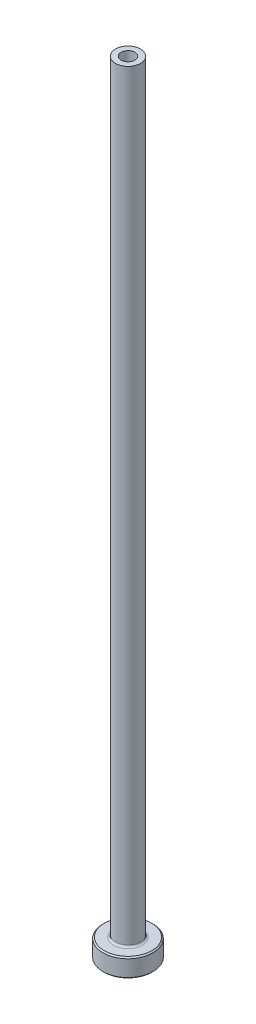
ISO-10303-21;
HEADER;
FILE_DESCRIPTION(('STEP AP214'),'2;1');
FILE_NAME('part.step','',(''),(''),'','','');
FILE_SCHEMA(('AUTOMOTIVE_DESIGN { 1 0 10303 214 1 1 1 1 }'));
ENDSEC;
DATA;
#1=APPLICATION_CONTEXT('core data for automotive mechanical design processes');
#2=APPLICATION_PROTOCOL_DEFINITION('international standard','automotive_design',2000,#1);
#3=PRODUCT_CONTEXT('',#1,'mechanical');
#4=PRODUCT('Part','Part','',(#3));
#5=PRODUCT_RELATED_PRODUCT_CATEGORY('part','',(#4));
#6=PRODUCT_DEFINITION_FORMATION('','',#4);
#7=PRODUCT_DEFINITION_CONTEXT('part definition',#1,'design');
#8=PRODUCT_DEFINITION('design','',#6,#7);
#9=PRODUCT_DEFINITION_SHAPE('','',#8);
#10=(LENGTH_UNIT() NAMED_UNIT(*) SI_UNIT(.MILLI.,.METRE.));
#11=(NAMED_UNIT(*) PLANE_ANGLE_UNIT() SI_UNIT($,.RADIAN.));
#12=(NAMED_UNIT(*) SI_UNIT($,.STERADIAN.) SOLID_ANGLE_UNIT());
#13=UNCERTAINTY_MEASURE_WITH_UNIT(LENGTH_MEASURE(1.E-05),#10,'distance_accuracy_value','');
#14=(GEOMETRIC_REPRESENTATION_CONTEXT(3) GLOBAL_UNCERTAINTY_ASSIGNED_CONTEXT((#13)) GLOBAL_UNIT_ASSIGNED_CONTEXT((#10,
#11,#12)) REPRESENTATION_CONTEXT('',''));
#15=CARTESIAN_POINT('',(0.,0.,0.));
#16=DIRECTION('',(0.,0.,1.));
#17=DIRECTION('',(1.,0.,0.));
#18=AXIS2_PLACEMENT_3D('',#15,#16,#17);
#19=CARTESIAN_POINT('',(0.,92.1876809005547,0.));
#20=DIRECTION('',(0.,1.,0.));
#21=DIRECTION('',(0.,0.,1.));
#22=AXIS2_PLACEMENT_3D('',#19,#20,#21);
#23=CYLINDRICAL_SURFACE('',#22,1.1);
#24=CARTESIAN_POINT('',(0.,125.,0.));
#25=DIRECTION('',(0.,1.,0.));
#26=DIRECTION('',(0.,0.,1.));
#27=AXIS2_PLACEMENT_3D('',#24,#25,#26);
#28=CIRCLE('',#27,1.1);
#29=CARTESIAN_POINT('',(0.,125.,1.1));
#30=VERTEX_POINT('',#29);
#31=EDGE_CURVE('E62',#30,#30,#28,.T.);
#32=ORIENTED_EDGE('',*,*,#31,.T.);
#33=EDGE_LOOP('',(#32));
#34=FACE_BOUND('',#33,.T.);
#35=CARTESIAN_POINT('',(0.,90.,0.));
#36=DIRECTION('',(0.,1.,0.));
#37=DIRECTION('',(0.,0.,1.));
#38=AXIS2_PLACEMENT_3D('',#35,#36,#37);
#39=CIRCLE('',#38,1.1);
#40=CARTESIAN_POINT('',(0.,90.,1.1));
#41=VERTEX_POINT('',#40);
#42=EDGE_CURVE('E71',#41,#41,#39,.T.);
#43=ORIENTED_EDGE('',*,*,#42,.F.);
#44=EDGE_LOOP('',(#43));
#45=FACE_BOUND('',#44,.T.);
#46=ADVANCED_FACE('F30',(#34,#45),#23,.F.);
#47=CARTESIAN_POINT('',(-1.1,125.,0.));
#48=DIRECTION('',(0.,1.,0.));
#49=DIRECTION('',(0.,0.,1.));
#50=AXIS2_PLACEMENT_3D('',#47,#48,#49);
#51=PLANE('',#50);
#52=CARTESIAN_POINT('',(0.,125.,0.));
#53=DIRECTION('',(0.,1.,0.));
#54=DIRECTION('',(0.,0.,1.));
#55=AXIS2_PLACEMENT_3D('',#52,#53,#54);
#56=CIRCLE('',#55,2.);
#57=CARTESIAN_POINT('',(0.,125.,2.));
#58=VERTEX_POINT('',#57);
#59=EDGE_CURVE('E65',#58,#58,#56,.T.);
#60=ORIENTED_EDGE('',*,*,#59,.T.);
#61=EDGE_LOOP('',(#60));
#62=FACE_BOUND('',#61,.T.);
#63=ORIENTED_EDGE('',*,*,#31,.F.);
#64=EDGE_LOOP('',(#63));
#65=FACE_BOUND('',#64,.T.);
#66=ADVANCED_FACE('F79',(#62,#65),#51,.T.);
#67=CARTESIAN_POINT('',(0.,92.1876809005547,0.));
#68=DIRECTION('',(0.,1.,0.));
#69=DIRECTION('',(0.,0.,1.));
#70=AXIS2_PLACEMENT_3D('',#67,#68,#69);
#71=CYLINDRICAL_SURFACE('',#70,2.);
#72=CARTESIAN_POINT('',(0.,3.3,0.));
#73=DIRECTION('',(0.,1.,0.));
#74=DIRECTION('',(0.,0.,1.));
#75=AXIS2_PLACEMENT_3D('',#72,#73,#74);
#76=CIRCLE('',#75,2.);
#77=CARTESIAN_POINT('',(0.,3.3,2.));
#78=VERTEX_POINT('',#77);
#79=EDGE_CURVE('E59',#78,#78,#76,.T.);
#80=ORIENTED_EDGE('',*,*,#79,.T.);
#81=EDGE_LOOP('',(#80));
#82=FACE_BOUND('',#81,.T.);
#83=ORIENTED_EDGE('',*,*,#59,.F.);
#84=EDGE_LOOP('',(#83));
#85=FACE_BOUND('',#84,.T.);
#86=ADVANCED_FACE('F85',(#82,#85),#71,.T.);
#87=CARTESIAN_POINT('',(-1.99999999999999,3.,0.));
#88=DIRECTION('',(0.,1.,0.));
#89=DIRECTION('',(0.,0.,1.));
#90=AXIS2_PLACEMENT_3D('',#87,#88,#89);
#91=PLANE('',#90);
#92=CARTESIAN_POINT('',(0.,3.,0.));
#93=DIRECTION('',(0.,1.,0.));
#94=DIRECTION('',(0.,0.,1.));
#95=AXIS2_PLACEMENT_3D('',#92,#93,#94);
#96=CIRCLE('',#95,3.79999999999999);
#97=CARTESIAN_POINT('',(0.,3.,3.79999999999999));
#98=VERTEX_POINT('',#97);
#99=EDGE_CURVE('E53',#98,#98,#96,.T.);
#100=ORIENTED_EDGE('',*,*,#99,.T.);
#101=EDGE_LOOP('',(#100));
#102=FACE_BOUND('',#101,.T.);
#103=CARTESIAN_POINT('',(0.,3.,0.));
#104=DIRECTION('',(0.,1.,0.));
#105=DIRECTION('',(0.,0.,1.));
#106=AXIS2_PLACEMENT_3D('',#103,#104,#105);
#107=CIRCLE('',#106,2.3);
#108=CARTESIAN_POINT('',(0.,3.,2.3));
#109=VERTEX_POINT('',#108);
#110=EDGE_CURVE('E56',#109,#109,#107,.F.);
#111=ORIENTED_EDGE('',*,*,#110,.T.);
#112=EDGE_LOOP('',(#111));
#113=FACE_BOUND('',#112,.T.);
#114=ADVANCED_FACE('F111',(#102,#113),#91,.T.);
#115=CARTESIAN_POINT('',(0.,92.1876809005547,0.));
#116=DIRECTION('',(0.,1.,0.));
#117=DIRECTION('',(0.,0.,1.));
#118=AXIS2_PLACEMENT_3D('',#115,#116,#117);
#119=CYLINDRICAL_SURFACE('',#118,3.99999999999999);
#120=CARTESIAN_POINT('',(0.,2.8,0.));
#121=DIRECTION('',(0.,1.,0.));
#122=DIRECTION('',(0.,0.,1.));
#123=AXIS2_PLACEMENT_3D('',#120,#121,#122);
#124=CIRCLE('',#123,3.99999999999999);
#125=CARTESIAN_POINT('',(0.,2.8,3.99999999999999));
#126=VERTEX_POINT('',#125);
#127=EDGE_CURVE('E45',#126,#126,#124,.F.);
#128=ORIENTED_EDGE('',*,*,#127,.T.);
#129=EDGE_LOOP('',(#128));
#130=FACE_BOUND('',#129,.T.);
#131=CARTESIAN_POINT('',(0.,0.200000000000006,0.));
#132=DIRECTION('',(0.,-1.,0.));
#133=DIRECTION('',(0.,0.,-1.));
#134=AXIS2_PLACEMENT_3D('',#131,#132,#133);
#135=CIRCLE('',#134,3.99999999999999);
#136=CARTESIAN_POINT('',(0.,0.200000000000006,-3.99999999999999));
#137=VERTEX_POINT('',#136);
#138=EDGE_CURVE('E50',#137,#137,#135,.F.);
#139=ORIENTED_EDGE('',*,*,#138,.T.);
#140=EDGE_LOOP('',(#139));
#141=FACE_BOUND('',#140,.T.);
#142=ADVANCED_FACE('F108',(#130,#141),#119,.T.);
#143=CARTESIAN_POINT('',(-3.99999999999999,0.,0.));
#144=DIRECTION('',(0.,-1.,0.));
#145=DIRECTION('',(0.,0.,-1.));
#146=AXIS2_PLACEMENT_3D('',#143,#144,#145);
#147=PLANE('',#146);
#148=CARTESIAN_POINT('',(0.,0.,0.));
#149=DIRECTION('',(0.,-1.,0.));
#150=DIRECTION('',(0.,0.,-1.));
#151=AXIS2_PLACEMENT_3D('',#148,#149,#150);
#152=CIRCLE('',#151,1.84999999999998);
#153=CARTESIAN_POINT('',(0.,0.,-1.84999999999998));
#154=VERTEX_POINT('',#153);
#155=EDGE_CURVE('E37',#154,#154,#152,.F.);
#156=ORIENTED_EDGE('',*,*,#155,.T.);
#157=EDGE_LOOP('',(#156));
#158=FACE_BOUND('',#157,.T.);
#159=CARTESIAN_POINT('',(0.,0.,0.));
#160=DIRECTION('',(0.,-1.,0.));
#161=DIRECTION('',(0.,0.,-1.));
#162=AXIS2_PLACEMENT_3D('',#159,#160,#161);
#163=CIRCLE('',#162,3.79999999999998);
#164=CARTESIAN_POINT('',(0.,0.,-3.79999999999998));
#165=VERTEX_POINT('',#164);
#166=EDGE_CURVE('E41',#165,#165,#163,.T.);
#167=ORIENTED_EDGE('',*,*,#166,.T.);
#168=EDGE_LOOP('',(#167));
#169=FACE_BOUND('',#168,.T.);
#170=ADVANCED_FACE('F110',(#158,#169),#147,.T.);
#171=CARTESIAN_POINT('',(0.,92.1876809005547,0.));
#172=DIRECTION('',(0.,1.,0.));
#173=DIRECTION('',(0.,0.,1.));
#174=AXIS2_PLACEMENT_3D('',#171,#172,#173);
#175=CYLINDRICAL_SURFACE('',#174,1.34999999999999);
#176=CARTESIAN_POINT('',(0.,0.499999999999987,0.));
#177=DIRECTION('',(0.,-1.,0.));
#178=DIRECTION('',(0.,0.,-1.));
#179=AXIS2_PLACEMENT_3D('',#176,#177,#178);
#180=CIRCLE('',#179,1.34999999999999);
#181=CARTESIAN_POINT('',(0.,0.499999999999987,-1.34999999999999));
#182=VERTEX_POINT('',#181);
#183=EDGE_CURVE('E10',#182,#182,#180,.T.);
#184=ORIENTED_EDGE('',*,*,#183,.T.);
#185=EDGE_LOOP('',(#184));
#186=FACE_BOUND('',#185,.T.);
#187=CARTESIAN_POINT('',(0.,78.,0.));
#188=DIRECTION('',(0.,1.,0.));
#189=DIRECTION('',(0.,0.,1.));
#190=AXIS2_PLACEMENT_3D('',#187,#188,#189);
#191=CIRCLE('',#190,1.35);
#192=CARTESIAN_POINT('',(0.,78.,1.35));
#193=VERTEX_POINT('',#192);
#194=EDGE_CURVE('E68',#193,#193,#191,.T.);
#195=ORIENTED_EDGE('',*,*,#194,.T.);
#196=EDGE_LOOP('',(#195));
#197=FACE_BOUND('',#196,.T.);
#198=ADVANCED_FACE('F118',(#186,#197),#175,.F.);
#199=CARTESIAN_POINT('',(0.,78.,0.));
#200=DIRECTION('',(0.,-1.,0.));
#201=DIRECTION('',(0.,0.,-1.));
#202=AXIS2_PLACEMENT_3D('',#199,#200,#201);
#203=CONICAL_SURFACE('',#202,1.35,0.0208303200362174);
#204=ORIENTED_EDGE('',*,*,#42,.T.);
#205=EDGE_LOOP('',(#204));
#206=FACE_BOUND('',#205,.T.);
#207=ORIENTED_EDGE('',*,*,#194,.F.);
#208=EDGE_LOOP('',(#207));
#209=FACE_BOUND('',#208,.T.);
#210=ADVANCED_FACE('F75',(#206,#209),#203,.F.);
#211=CARTESIAN_POINT('',(0.,3.3,0.));
#212=DIRECTION('',(0.,1.,0.));
#213=DIRECTION('',(0.,0.,1.));
#214=AXIS2_PLACEMENT_3D('',#211,#212,#213);
#215=TOROIDAL_SURFACE('',#214,2.3,0.3);
#216=ORIENTED_EDGE('',*,*,#110,.F.);
#217=EDGE_LOOP('',(#216));
#218=FACE_BOUND('',#217,.T.);
#219=ORIENTED_EDGE('',*,*,#79,.F.);
#220=EDGE_LOOP('',(#219));
#221=FACE_BOUND('',#220,.T.);
#222=ADVANCED_FACE('F90',(#218,#221),#215,.F.);
#223=CARTESIAN_POINT('',(0.,3.,0.));
#224=DIRECTION('',(0.,-1.,0.));
#225=DIRECTION('',(0.,0.,-1.));
#226=AXIS2_PLACEMENT_3D('',#223,#224,#225);
#227=CONICAL_SURFACE('',#226,3.79999999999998,0.785398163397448);
#228=ORIENTED_EDGE('',*,*,#127,.F.);
#229=EDGE_LOOP('',(#228));
#230=FACE_BOUND('',#229,.T.);
#231=ORIENTED_EDGE('',*,*,#99,.F.);
#232=EDGE_LOOP('',(#231));
#233=FACE_BOUND('',#232,.T.);
#234=ADVANCED_FACE('F93',(#230,#233),#227,.T.);
#235=CARTESIAN_POINT('',(0.,0.200000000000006,0.));
#236=DIRECTION('',(0.,1.,0.));
#237=DIRECTION('',(0.,0.,1.));
#238=AXIS2_PLACEMENT_3D('',#235,#236,#237);
#239=CONICAL_SURFACE('',#238,3.99999999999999,0.785398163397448);
#240=ORIENTED_EDGE('',*,*,#166,.F.);
#241=EDGE_LOOP('',(#240));
#242=FACE_BOUND('',#241,.T.);
#243=ORIENTED_EDGE('',*,*,#138,.F.);
#244=EDGE_LOOP('',(#243));
#245=FACE_BOUND('',#244,.T.);
#246=ADVANCED_FACE('F96',(#242,#245),#239,.T.);
#247=CARTESIAN_POINT('',(0.,0.,0.));
#248=DIRECTION('',(0.,-1.,0.));
#249=DIRECTION('',(0.,0.,-1.));
#250=AXIS2_PLACEMENT_3D('',#247,#248,#249);
#251=CONICAL_SURFACE('',#250,1.84999999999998,0.785398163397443);
#252=ORIENTED_EDGE('',*,*,#183,.F.);
#253=EDGE_LOOP('',(#252));
#254=FACE_BOUND('',#253,.T.);
#255=ORIENTED_EDGE('',*,*,#155,.F.);
#256=EDGE_LOOP('',(#255));
#257=FACE_BOUND('',#256,.T.);
#258=ADVANCED_FACE('F32',(#254,#257),#251,.F.);
#259=CLOSED_SHELL('',(#46,#66,#86,#114,#142,#170,#198,#210,#222,#234,#246,#258));
#260=MANIFOLD_SOLID_BREP('B2',#259);
#261=ADVANCED_BREP_SHAPE_REPRESENTATION('',(#18,#260),#14);
#262=SHAPE_DEFINITION_REPRESENTATION(#9,#261);
ENDSEC;
END-ISO-10303-21;
